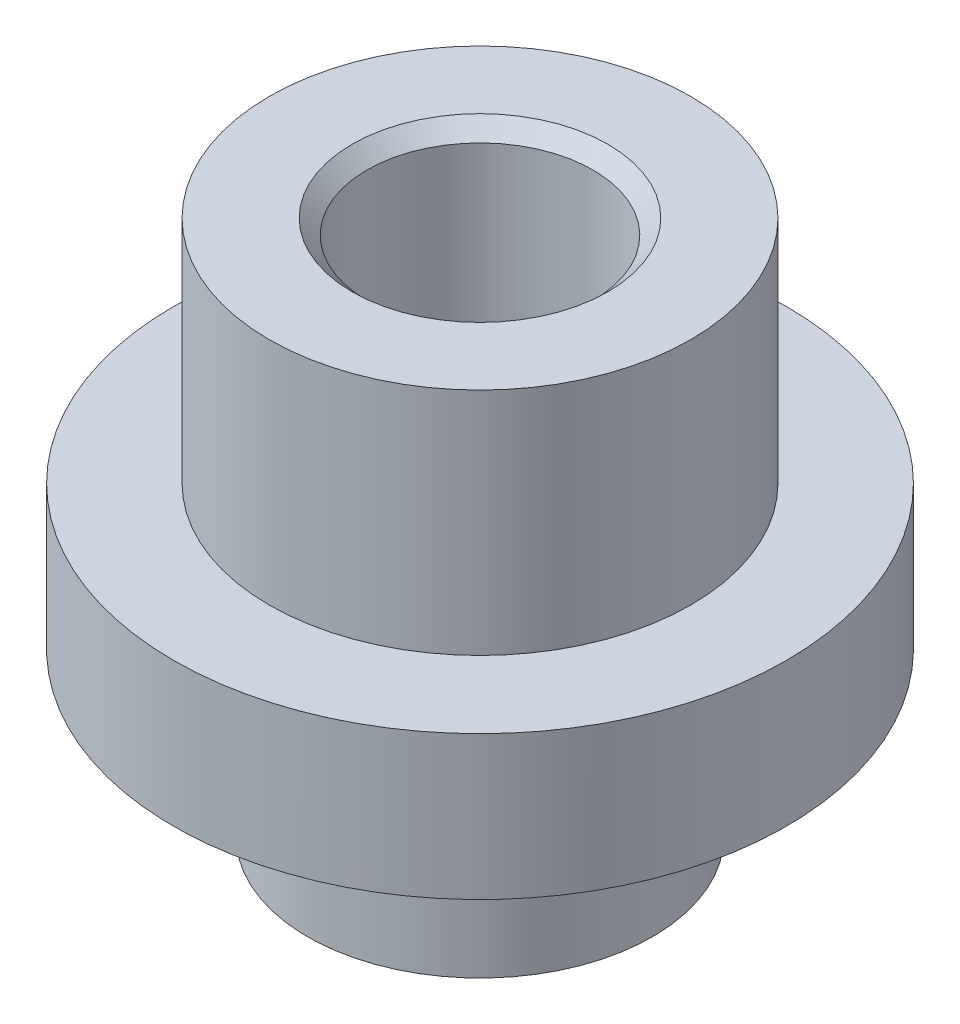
ISO-10303-21;
HEADER;
FILE_DESCRIPTION(('STEP AP214'),'2;1');
FILE_NAME('part.step','',(''),(''),'','','');
FILE_SCHEMA(('AUTOMOTIVE_DESIGN { 1 0 10303 214 1 1 1 1 }'));
ENDSEC;
DATA;
#1=APPLICATION_CONTEXT('core data for automotive mechanical design processes');
#2=APPLICATION_PROTOCOL_DEFINITION('international standard','automotive_design',2000,#1);
#3=PRODUCT_CONTEXT('',#1,'mechanical');
#4=PRODUCT('Part','Part','',(#3));
#5=PRODUCT_RELATED_PRODUCT_CATEGORY('part','',(#4));
#6=PRODUCT_DEFINITION_FORMATION('','',#4);
#7=PRODUCT_DEFINITION_CONTEXT('part definition',#1,'design');
#8=PRODUCT_DEFINITION('design','',#6,#7);
#9=PRODUCT_DEFINITION_SHAPE('','',#8);
#10=(LENGTH_UNIT() NAMED_UNIT(*) SI_UNIT(.MILLI.,.METRE.));
#11=(NAMED_UNIT(*) PLANE_ANGLE_UNIT() SI_UNIT($,.RADIAN.));
#12=(NAMED_UNIT(*) SI_UNIT($,.STERADIAN.) SOLID_ANGLE_UNIT());
#13=UNCERTAINTY_MEASURE_WITH_UNIT(LENGTH_MEASURE(1.E-05),#10,'distance_accuracy_value','');
#14=(GEOMETRIC_REPRESENTATION_CONTEXT(3) GLOBAL_UNCERTAINTY_ASSIGNED_CONTEXT((#13)) GLOBAL_UNIT_ASSIGNED_CONTEXT((#10,
#11,#12)) REPRESENTATION_CONTEXT('',''));
#15=CARTESIAN_POINT('',(0.,0.,0.));
#16=DIRECTION('',(0.,0.,1.));
#17=DIRECTION('',(1.,0.,0.));
#18=AXIS2_PLACEMENT_3D('',#15,#16,#17);
#19=CARTESIAN_POINT('',(0.,8.5,0.));
#20=DIRECTION('',(0.,-1.,0.));
#21=DIRECTION('',(0.,0.,-1.));
#22=AXIS2_PLACEMENT_3D('',#19,#20,#21);
#23=CYLINDRICAL_SURFACE('',#22,10.9);
#24=CARTESIAN_POINT('',(0.,8.2,0.));
#25=DIRECTION('',(0.,-1.,0.));
#26=DIRECTION('',(0.,0.,-1.));
#27=AXIS2_PLACEMENT_3D('',#24,#25,#26);
#28=CIRCLE('',#27,10.9);
#29=CARTESIAN_POINT('',(0.,8.2,-10.9));
#30=VERTEX_POINT('',#29);
#31=EDGE_CURVE('E46',#30,#30,#28,.T.);
#32=ORIENTED_EDGE('',*,*,#31,.T.);
#33=EDGE_LOOP('',(#32));
#34=FACE_BOUND('',#33,.T.);
#35=CARTESIAN_POINT('',(0.,7.,0.));
#36=DIRECTION('',(0.,-1.,0.));
#37=DIRECTION('',(0.,0.,-1.));
#38=AXIS2_PLACEMENT_3D('',#35,#36,#37);
#39=CIRCLE('',#38,10.9);
#40=CARTESIAN_POINT('',(0.,7.,-10.9));
#41=VERTEX_POINT('',#40);
#42=EDGE_CURVE('E53',#41,#41,#39,.F.);
#43=ORIENTED_EDGE('',*,*,#42,.T.);
#44=EDGE_LOOP('',(#43));
#45=FACE_BOUND('',#44,.T.);
#46=ADVANCED_FACE('F38',(#34,#45),#23,.T.);
#47=CARTESIAN_POINT('',(0.,28.,0.));
#48=DIRECTION('',(0.,-1.,0.));
#49=DIRECTION('',(0.,0.,-1.));
#50=AXIS2_PLACEMENT_3D('',#47,#48,#49);
#51=CYLINDRICAL_SURFACE('',#50,16.);
#52=CARTESIAN_POINT('',(0.,16.,0.));
#53=DIRECTION('',(0.,1.,0.));
#54=DIRECTION('',(0.,0.,1.));
#55=AXIS2_PLACEMENT_3D('',#52,#53,#54);
#56=CIRCLE('',#55,16.);
#57=CARTESIAN_POINT('',(0.,16.,16.));
#58=VERTEX_POINT('',#57);
#59=EDGE_CURVE('E50',#58,#58,#56,.T.);
#60=ORIENTED_EDGE('',*,*,#59,.F.);
#61=EDGE_LOOP('',(#60));
#62=FACE_BOUND('',#61,.T.);
#63=CARTESIAN_POINT('',(0.,8.5,0.));
#64=DIRECTION('',(0.,-1.,0.));
#65=DIRECTION('',(0.,0.,-1.));
#66=AXIS2_PLACEMENT_3D('',#63,#64,#65);
#67=CIRCLE('',#66,16.);
#68=CARTESIAN_POINT('',(0.,8.5,-16.));
#69=VERTEX_POINT('',#68);
#70=EDGE_CURVE('E56',#69,#69,#67,.T.);
#71=ORIENTED_EDGE('',*,*,#70,.F.);
#72=EDGE_LOOP('',(#71));
#73=FACE_BOUND('',#72,.T.);
#74=ADVANCED_FACE('F103',(#62,#73),#51,.T.);
#75=CARTESIAN_POINT('',(0.,16.,0.));
#76=DIRECTION('',(0.,1.,0.));
#77=DIRECTION('',(0.,0.,1.));
#78=AXIS2_PLACEMENT_3D('',#75,#76,#77);
#79=PLANE('',#78);
#80=CARTESIAN_POINT('',(0.,16.,0.));
#81=DIRECTION('',(0.,1.,0.));
#82=DIRECTION('',(0.,0.,1.));
#83=AXIS2_PLACEMENT_3D('',#80,#81,#82);
#84=CIRCLE('',#83,11.);
#85=CARTESIAN_POINT('',(0.,16.,11.));
#86=VERTEX_POINT('',#85);
#87=EDGE_CURVE('E63',#86,#86,#84,.T.);
#88=ORIENTED_EDGE('',*,*,#87,.F.);
#89=EDGE_LOOP('',(#88));
#90=FACE_BOUND('',#89,.T.);
#91=ORIENTED_EDGE('',*,*,#59,.T.);
#92=EDGE_LOOP('',(#91));
#93=FACE_BOUND('',#92,.T.);
#94=ADVANCED_FACE('F109',(#90,#93),#79,.T.);
#95=CARTESIAN_POINT('',(0.,16.,0.));
#96=DIRECTION('',(0.,1.,0.));
#97=DIRECTION('',(0.,0.,1.));
#98=AXIS2_PLACEMENT_3D('',#95,#96,#97);
#99=CYLINDRICAL_SURFACE('',#98,11.);
#100=ORIENTED_EDGE('',*,*,#87,.T.);
#101=EDGE_LOOP('',(#100));
#102=FACE_BOUND('',#101,.T.);
#103=CARTESIAN_POINT('',(0.,28.,0.));
#104=DIRECTION('',(0.,1.,0.));
#105=DIRECTION('',(0.,0.,1.));
#106=AXIS2_PLACEMENT_3D('',#103,#104,#105);
#107=CIRCLE('',#106,11.);
#108=CARTESIAN_POINT('',(0.,28.,11.));
#109=VERTEX_POINT('',#108);
#110=EDGE_CURVE('E60',#109,#109,#107,.T.);
#111=ORIENTED_EDGE('',*,*,#110,.F.);
#112=EDGE_LOOP('',(#111));
#113=FACE_BOUND('',#112,.T.);
#114=ADVANCED_FACE('F120',(#102,#113),#99,.T.);
#115=CARTESIAN_POINT('',(0.,28.,0.));
#116=DIRECTION('',(0.,1.,0.));
#117=DIRECTION('',(0.,0.,1.));
#118=AXIS2_PLACEMENT_3D('',#115,#116,#117);
#119=PLANE('',#118);
#120=CARTESIAN_POINT('',(0.,28.,0.));
#121=DIRECTION('',(0.,1.,0.));
#122=DIRECTION('',(0.,0.,1.));
#123=AXIS2_PLACEMENT_3D('',#120,#121,#122);
#124=CIRCLE('',#123,6.675);
#125=CARTESIAN_POINT('',(0.,28.,6.675));
#126=VERTEX_POINT('',#125);
#127=EDGE_CURVE('E79',#126,#126,#124,.T.);
#128=ORIENTED_EDGE('',*,*,#127,.F.);
#129=EDGE_LOOP('',(#128));
#130=FACE_BOUND('',#129,.T.);
#131=ORIENTED_EDGE('',*,*,#110,.T.);
#132=EDGE_LOOP('',(#131));
#133=FACE_BOUND('',#132,.T.);
#134=ADVANCED_FACE('F119',(#130,#133),#119,.T.);
#135=CARTESIAN_POINT('',(0.,8.5,0.));
#136=DIRECTION('',(0.,-1.,0.));
#137=DIRECTION('',(0.,0.,-1.));
#138=AXIS2_PLACEMENT_3D('',#135,#136,#137);
#139=PLANE('',#138);
#140=CARTESIAN_POINT('',(0.,8.5,0.));
#141=DIRECTION('',(0.,-1.,0.));
#142=DIRECTION('',(0.,0.,-1.));
#143=AXIS2_PLACEMENT_3D('',#140,#141,#142);
#144=CIRCLE('',#143,11.2);
#145=CARTESIAN_POINT('',(0.,8.5,-11.2));
#146=VERTEX_POINT('',#145);
#147=EDGE_CURVE('E11',#146,#146,#144,.F.);
#148=ORIENTED_EDGE('',*,*,#147,.T.);
#149=EDGE_LOOP('',(#148));
#150=FACE_BOUND('',#149,.T.);
#151=ORIENTED_EDGE('',*,*,#70,.T.);
#152=EDGE_LOOP('',(#151));
#153=FACE_BOUND('',#152,.T.);
#154=ADVANCED_FACE('F116',(#150,#153),#139,.T.);
#155=CARTESIAN_POINT('',(0.,7.,0.));
#156=DIRECTION('',(0.,-1.,0.));
#157=DIRECTION('',(0.,0.,-1.));
#158=AXIS2_PLACEMENT_3D('',#155,#156,#157);
#159=PLANE('',#158);
#160=ORIENTED_EDGE('',*,*,#42,.F.);
#161=EDGE_LOOP('',(#160));
#162=FACE_BOUND('',#161,.T.);
#163=CARTESIAN_POINT('',(0.,7.,0.));
#164=DIRECTION('',(0.,-1.,0.));
#165=DIRECTION('',(0.,0.,-1.));
#166=AXIS2_PLACEMENT_3D('',#163,#164,#165);
#167=CIRCLE('',#166,9.);
#168=CARTESIAN_POINT('',(0.,7.,-9.));
#169=VERTEX_POINT('',#168);
#170=EDGE_CURVE('E57',#169,#169,#167,.T.);
#171=ORIENTED_EDGE('',*,*,#170,.F.);
#172=EDGE_LOOP('',(#171));
#173=FACE_BOUND('',#172,.T.);
#174=ADVANCED_FACE('F114',(#162,#173),#159,.T.);
#175=CARTESIAN_POINT('',(0.,7.,0.));
#176=DIRECTION('',(0.,-1.,0.));
#177=DIRECTION('',(0.,0.,-1.));
#178=AXIS2_PLACEMENT_3D('',#175,#176,#177);
#179=CYLINDRICAL_SURFACE('',#178,9.);
#180=ORIENTED_EDGE('',*,*,#170,.T.);
#181=EDGE_LOOP('',(#180));
#182=FACE_BOUND('',#181,.T.);
#183=CARTESIAN_POINT('',(0.,0.,0.));
#184=DIRECTION('',(0.,-1.,0.));
#185=DIRECTION('',(0.,0.,-1.));
#186=AXIS2_PLACEMENT_3D('',#183,#184,#185);
#187=CIRCLE('',#186,9.);
#188=CARTESIAN_POINT('',(0.,0.,-9.));
#189=VERTEX_POINT('',#188);
#190=EDGE_CURVE('E68',#189,#189,#187,.T.);
#191=ORIENTED_EDGE('',*,*,#190,.F.);
#192=EDGE_LOOP('',(#191));
#193=FACE_BOUND('',#192,.T.);
#194=ADVANCED_FACE('F132',(#182,#193),#179,.T.);
#195=CARTESIAN_POINT('',(0.,0.,0.));
#196=DIRECTION('',(0.,1.,0.));
#197=DIRECTION('',(0.,0.,1.));
#198=AXIS2_PLACEMENT_3D('',#195,#196,#197);
#199=PLANE('',#198);
#200=CARTESIAN_POINT('',(0.,0.,0.));
#201=DIRECTION('',(0.,-1.,0.));
#202=DIRECTION('',(0.,0.,-1.));
#203=AXIS2_PLACEMENT_3D('',#200,#201,#202);
#204=CIRCLE('',#203,5.);
#205=CARTESIAN_POINT('',(0.,0.,-5.));
#206=VERTEX_POINT('',#205);
#207=EDGE_CURVE('E82',#206,#206,#204,.T.);
#208=ORIENTED_EDGE('',*,*,#207,.F.);
#209=EDGE_LOOP('',(#208));
#210=FACE_BOUND('',#209,.T.);
#211=ORIENTED_EDGE('',*,*,#190,.T.);
#212=EDGE_LOOP('',(#211));
#213=FACE_BOUND('',#212,.T.);
#214=ADVANCED_FACE('F130',(#210,#213),#199,.F.);
#215=CARTESIAN_POINT('',(0.,8.2,0.));
#216=DIRECTION('',(0.,-1.,0.));
#217=DIRECTION('',(0.,0.,-1.));
#218=AXIS2_PLACEMENT_3D('',#215,#216,#217);
#219=TOROIDAL_SURFACE('',#218,11.2,0.3);
#220=ORIENTED_EDGE('',*,*,#147,.F.);
#221=EDGE_LOOP('',(#220));
#222=FACE_BOUND('',#221,.T.);
#223=ORIENTED_EDGE('',*,*,#31,.F.);
#224=EDGE_LOOP('',(#223));
#225=FACE_BOUND('',#224,.T.);
#226=ADVANCED_FACE('F40',(#222,#225),#219,.F.);
#227=CARTESIAN_POINT('',(0.,12.,0.));
#228=DIRECTION('',(0.,1.,0.));
#229=DIRECTION('',(0.,0.,1.));
#230=AXIS2_PLACEMENT_3D('',#227,#228,#229);
#231=CONICAL_SURFACE('',#230,5.89999999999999,1.0471975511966);
#232=CARTESIAN_POINT('',(0.,11.4803847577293,0.));
#233=DIRECTION('',(0.,1.,0.));
#234=DIRECTION('',(0.,0.,1.));
#235=AXIS2_PLACEMENT_3D('',#232,#233,#234);
#236=CIRCLE('',#235,5.);
#237=CARTESIAN_POINT('',(0.,11.4803847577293,5.));
#238=VERTEX_POINT('',#237);
#239=EDGE_CURVE('E42',#238,#238,#236,.F.);
#240=ORIENTED_EDGE('',*,*,#239,.T.);
#241=EDGE_LOOP('',(#240));
#242=FACE_BOUND('',#241,.T.);
#243=CARTESIAN_POINT('',(0.,12.,0.));
#244=DIRECTION('',(0.,1.,0.));
#245=DIRECTION('',(0.,0.,1.));
#246=AXIS2_PLACEMENT_3D('',#243,#244,#245);
#247=CIRCLE('',#246,5.89999999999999);
#248=CARTESIAN_POINT('',(0.,12.,5.89999999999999));
#249=VERTEX_POINT('',#248);
#250=EDGE_CURVE('E71',#249,#249,#247,.T.);
#251=ORIENTED_EDGE('',*,*,#250,.T.);
#252=EDGE_LOOP('',(#251));
#253=FACE_BOUND('',#252,.T.);
#254=ADVANCED_FACE('F89',(#242,#253),#231,.F.);
#255=CARTESIAN_POINT('',(0.,28.,0.));
#256=DIRECTION('',(0.,1.,0.));
#257=DIRECTION('',(0.,0.,1.));
#258=AXIS2_PLACEMENT_3D('',#255,#256,#257);
#259=CYLINDRICAL_SURFACE('',#258,5.89999999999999);
#260=ORIENTED_EDGE('',*,*,#250,.F.);
#261=EDGE_LOOP('',(#260));
#262=FACE_BOUND('',#261,.T.);
#263=CARTESIAN_POINT('',(0.,27.225,0.));
#264=DIRECTION('',(0.,1.,0.));
#265=DIRECTION('',(0.,0.,1.));
#266=AXIS2_PLACEMENT_3D('',#263,#264,#265);
#267=CIRCLE('',#266,5.9);
#268=CARTESIAN_POINT('',(0.,27.225,5.9));
#269=VERTEX_POINT('',#268);
#270=EDGE_CURVE('E76',#269,#269,#267,.T.);
#271=ORIENTED_EDGE('',*,*,#270,.T.);
#272=EDGE_LOOP('',(#271));
#273=FACE_BOUND('',#272,.T.);
#274=ADVANCED_FACE('F99',(#262,#273),#259,.F.);
#275=CARTESIAN_POINT('',(0.,28.,0.));
#276=DIRECTION('',(0.,1.,0.));
#277=DIRECTION('',(0.,0.,1.));
#278=AXIS2_PLACEMENT_3D('',#275,#276,#277);
#279=CONICAL_SURFACE('',#278,6.675,0.78539816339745);
#280=ORIENTED_EDGE('',*,*,#270,.F.);
#281=EDGE_LOOP('',(#280));
#282=FACE_BOUND('',#281,.T.);
#283=ORIENTED_EDGE('',*,*,#127,.T.);
#284=EDGE_LOOP('',(#283));
#285=FACE_BOUND('',#284,.T.);
#286=ADVANCED_FACE('F94',(#282,#285),#279,.F.);
#287=CARTESIAN_POINT('',(0.,28.,0.));
#288=DIRECTION('',(0.,-1.,0.));
#289=DIRECTION('',(0.,0.,-1.));
#290=AXIS2_PLACEMENT_3D('',#287,#288,#289);
#291=CYLINDRICAL_SURFACE('',#290,5.);
#292=ORIENTED_EDGE('',*,*,#207,.T.);
#293=EDGE_LOOP('',(#292));
#294=FACE_BOUND('',#293,.T.);
#295=ORIENTED_EDGE('',*,*,#239,.F.);
#296=EDGE_LOOP('',(#295));
#297=FACE_BOUND('',#296,.T.);
#298=ADVANCED_FACE('F92',(#294,#297),#291,.F.);
#299=CLOSED_SHELL('',(#46,#74,#94,#114,#134,#154,#174,#194,#214,#226,#254,#274,#286,#298));
#300=MANIFOLD_SOLID_BREP('B2',#299);
#301=ADVANCED_BREP_SHAPE_REPRESENTATION('',(#18,#300),#14);
#302=SHAPE_DEFINITION_REPRESENTATION(#9,#301);
ENDSEC;
END-ISO-10303-21;
